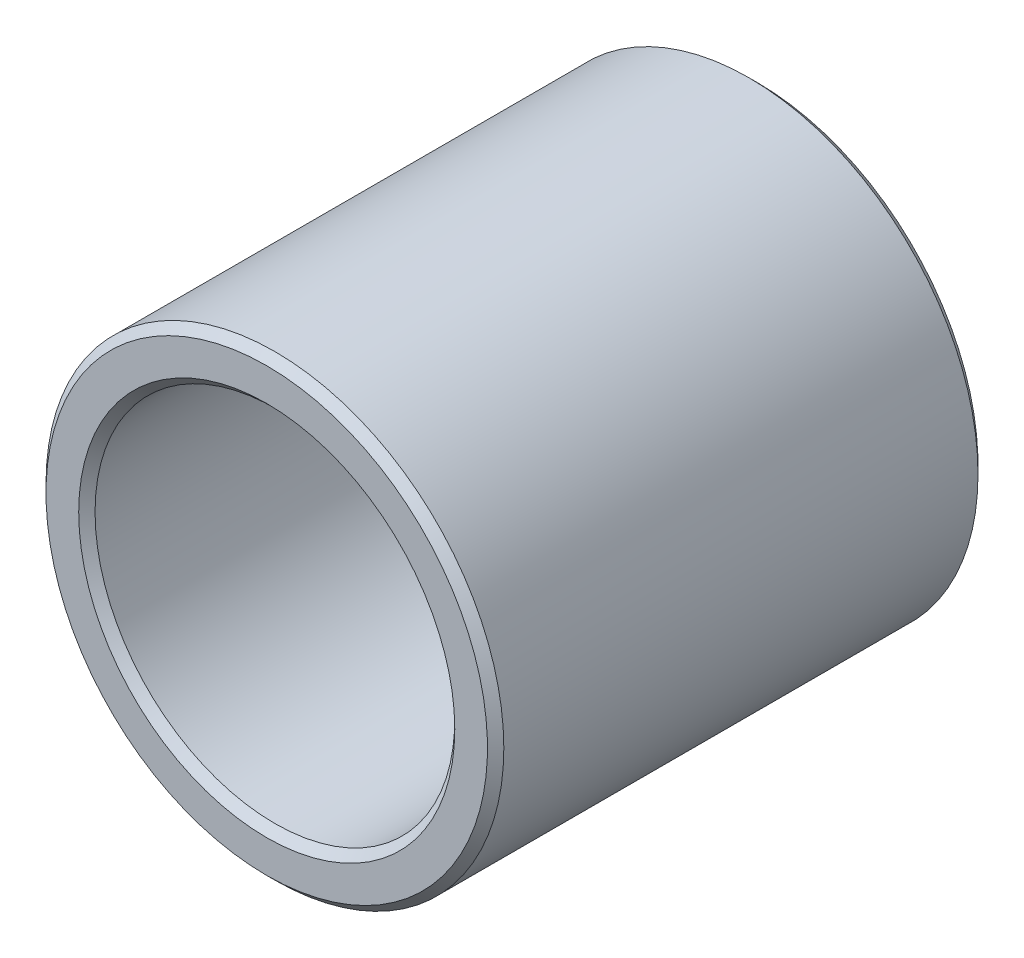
ISO-10303-21;
HEADER;
FILE_DESCRIPTION(('STEP AP214'),'2;1');
FILE_NAME('part.step','',(''),(''),'','','');
FILE_SCHEMA(('AUTOMOTIVE_DESIGN { 1 0 10303 214 1 1 1 1 }'));
ENDSEC;
DATA;
#1=APPLICATION_CONTEXT('core data for automotive mechanical design processes');
#2=APPLICATION_PROTOCOL_DEFINITION('international standard','automotive_design',2000,#1);
#3=PRODUCT_CONTEXT('',#1,'mechanical');
#4=PRODUCT('Part','Part','',(#3));
#5=PRODUCT_RELATED_PRODUCT_CATEGORY('part','',(#4));
#6=PRODUCT_DEFINITION_FORMATION('','',#4);
#7=PRODUCT_DEFINITION_CONTEXT('part definition',#1,'design');
#8=PRODUCT_DEFINITION('design','',#6,#7);
#9=PRODUCT_DEFINITION_SHAPE('','',#8);
#10=(LENGTH_UNIT() NAMED_UNIT(*) SI_UNIT(.MILLI.,.METRE.));
#11=(NAMED_UNIT(*) PLANE_ANGLE_UNIT() SI_UNIT($,.RADIAN.));
#12=(NAMED_UNIT(*) SI_UNIT($,.STERADIAN.) SOLID_ANGLE_UNIT());
#13=UNCERTAINTY_MEASURE_WITH_UNIT(LENGTH_MEASURE(1.E-05),#10,'distance_accuracy_value','');
#14=(GEOMETRIC_REPRESENTATION_CONTEXT(3) GLOBAL_UNCERTAINTY_ASSIGNED_CONTEXT((#13)) GLOBAL_UNIT_ASSIGNED_CONTEXT((#10,
#11,#12)) REPRESENTATION_CONTEXT('',''));
#15=CARTESIAN_POINT('',(0.,0.,0.));
#16=DIRECTION('',(0.,0.,1.));
#17=DIRECTION('',(1.,0.,0.));
#18=AXIS2_PLACEMENT_3D('',#15,#16,#17);
#19=CARTESIAN_POINT('',(0.,0.,0.));
#20=DIRECTION('',(0.,0.,1.));
#21=DIRECTION('',(1.,0.,0.));
#22=AXIS2_PLACEMENT_3D('',#19,#20,#21);
#23=CYLINDRICAL_SURFACE('',#22,11.);
#24=CARTESIAN_POINT('',(0.,0.,0.500000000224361));
#25=DIRECTION('',(0.,0.,-1.));
#26=DIRECTION('',(-1.,0.,0.));
#27=AXIS2_PLACEMENT_3D('',#24,#25,#26);
#28=CIRCLE('',#27,11.0000000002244);
#29=CARTESIAN_POINT('',(-11.0000000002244,0.,0.500000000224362));
#30=VERTEX_POINT('',#29);
#31=EDGE_CURVE('E34',#30,#30,#28,.T.);
#32=ORIENTED_EDGE('',*,*,#31,.T.);
#33=EDGE_LOOP('',(#32));
#34=FACE_BOUND('',#33,.T.);
#35=CARTESIAN_POINT('',(0.,0.,29.4999999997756));
#36=DIRECTION('',(0.,0.,1.));
#37=DIRECTION('',(-1.,0.,0.));
#38=AXIS2_PLACEMENT_3D('',#35,#36,#37);
#39=CIRCLE('',#38,11.0000000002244);
#40=CARTESIAN_POINT('',(-11.0000000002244,0.,29.4999999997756));
#41=VERTEX_POINT('',#40);
#42=EDGE_CURVE('E37',#41,#41,#39,.T.);
#43=ORIENTED_EDGE('',*,*,#42,.T.);
#44=EDGE_LOOP('',(#43));
#45=FACE_BOUND('',#44,.T.);
#46=ADVANCED_FACE('F15',(#34,#45),#23,.F.);
#47=CARTESIAN_POINT('',(0.,0.,30.0000000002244));
#48=DIRECTION('',(0.,0.,1.));
#49=DIRECTION('',(0.,-1.,0.));
#50=AXIS2_PLACEMENT_3D('',#47,#48,#49);
#51=CONICAL_SURFACE('',#50,11.4999999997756,0.7853981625);
#52=CARTESIAN_POINT('',(0.,0.,30.0000000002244));
#53=DIRECTION('',(0.,0.,1.));
#54=DIRECTION('',(0.,-1.,0.));
#55=AXIS2_PLACEMENT_3D('',#52,#53,#54);
#56=CIRCLE('',#55,11.4999999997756);
#57=CARTESIAN_POINT('',(0.,-11.4999999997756,30.0000000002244));
#58=VERTEX_POINT('',#57);
#59=EDGE_CURVE('E18',#58,#58,#56,.T.);
#60=ORIENTED_EDGE('',*,*,#59,.T.);
#61=EDGE_LOOP('',(#60));
#62=FACE_BOUND('',#61,.T.);
#63=ORIENTED_EDGE('',*,*,#42,.F.);
#64=EDGE_LOOP('',(#63));
#65=FACE_BOUND('',#64,.T.);
#66=ADVANCED_FACE('F55',(#62,#65),#51,.F.);
#67=CARTESIAN_POINT('',(0.,0.,-2.24363333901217E-10));
#68=DIRECTION('',(0.,0.,-1.));
#69=DIRECTION('',(-1.,0.,0.));
#70=AXIS2_PLACEMENT_3D('',#67,#68,#69);
#71=CONICAL_SURFACE('',#70,11.4999999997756,0.785398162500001);
#72=CARTESIAN_POINT('',(0.,0.,-2.24362954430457E-10));
#73=DIRECTION('',(0.,0.,-1.));
#74=DIRECTION('',(-1.,0.,0.));
#75=AXIS2_PLACEMENT_3D('',#72,#73,#74);
#76=CIRCLE('',#75,11.4999999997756);
#77=CARTESIAN_POINT('',(-11.4999999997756,0.,-2.24362954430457E-10));
#78=VERTEX_POINT('',#77);
#79=EDGE_CURVE('E48',#78,#78,#76,.F.);
#80=ORIENTED_EDGE('',*,*,#79,.F.);
#81=EDGE_LOOP('',(#80));
#82=FACE_BOUND('',#81,.T.);
#83=ORIENTED_EDGE('',*,*,#31,.F.);
#84=EDGE_LOOP('',(#83));
#85=FACE_BOUND('',#84,.T.);
#86=ADVANCED_FACE('F62',(#82,#85),#71,.F.);
#87=CARTESIAN_POINT('',(0.,0.,30.));
#88=DIRECTION('',(0.,0.,-1.));
#89=DIRECTION('',(-1.,0.,0.));
#90=AXIS2_PLACEMENT_3D('',#87,#88,#89);
#91=PLANE('',#90);
#92=ORIENTED_EDGE('',*,*,#59,.F.);
#93=EDGE_LOOP('',(#92));
#94=FACE_BOUND('',#93,.T.);
#95=CARTESIAN_POINT('',(0.,0.,30.0000000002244));
#96=DIRECTION('',(0.,0.,-1.));
#97=DIRECTION('',(0.,1.,0.));
#98=AXIS2_PLACEMENT_3D('',#95,#96,#97);
#99=CIRCLE('',#98,13.5000000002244);
#100=CARTESIAN_POINT('',(0.,13.5000000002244,30.0000000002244));
#101=VERTEX_POINT('',#100);
#102=EDGE_CURVE('E46',#101,#101,#99,.T.);
#103=ORIENTED_EDGE('',*,*,#102,.F.);
#104=EDGE_LOOP('',(#103));
#105=FACE_BOUND('',#104,.T.);
#106=ADVANCED_FACE('F58',(#94,#105),#91,.F.);
#107=CARTESIAN_POINT('',(0.,0.,0.));
#108=DIRECTION('',(0.,0.,-1.));
#109=DIRECTION('',(-1.,0.,0.));
#110=AXIS2_PLACEMENT_3D('',#107,#108,#109);
#111=PLANE('',#110);
#112=ORIENTED_EDGE('',*,*,#79,.T.);
#113=EDGE_LOOP('',(#112));
#114=FACE_BOUND('',#113,.T.);
#115=CARTESIAN_POINT('',(0.,0.,-2.24362087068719E-10));
#116=DIRECTION('',(0.,0.,1.));
#117=DIRECTION('',(0.,-1.,0.));
#118=AXIS2_PLACEMENT_3D('',#115,#116,#117);
#119=CIRCLE('',#118,13.5000000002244);
#120=CARTESIAN_POINT('',(0.,-13.5000000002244,-2.24362139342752E-10));
#121=VERTEX_POINT('',#120);
#122=EDGE_CURVE('E27',#121,#121,#119,.T.);
#123=ORIENTED_EDGE('',*,*,#122,.F.);
#124=EDGE_LOOP('',(#123));
#125=FACE_BOUND('',#124,.T.);
#126=ADVANCED_FACE('F61',(#114,#125),#111,.T.);
#127=CARTESIAN_POINT('',(0.,0.,29.4999999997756));
#128=DIRECTION('',(0.,0.,-1.));
#129=DIRECTION('',(0.,1.,0.));
#130=AXIS2_PLACEMENT_3D('',#127,#128,#129);
#131=CONICAL_SURFACE('',#130,13.9999999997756,0.785398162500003);
#132=CARTESIAN_POINT('',(0.,0.,29.5));
#133=DIRECTION('',(0.,0.,1.));
#134=DIRECTION('',(1.,0.,0.));
#135=AXIS2_PLACEMENT_3D('',#132,#133,#134);
#136=CIRCLE('',#135,14.);
#137=CARTESIAN_POINT('',(14.,0.,29.5));
#138=VERTEX_POINT('',#137);
#139=EDGE_CURVE('E22',#138,#138,#136,.F.);
#140=ORIENTED_EDGE('',*,*,#139,.F.);
#141=EDGE_LOOP('',(#140));
#142=FACE_BOUND('',#141,.T.);
#143=ORIENTED_EDGE('',*,*,#102,.T.);
#144=EDGE_LOOP('',(#143));
#145=FACE_BOUND('',#144,.T.);
#146=ADVANCED_FACE('F66',(#142,#145),#131,.T.);
#147=CARTESIAN_POINT('',(0.,0.,0.500000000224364));
#148=DIRECTION('',(0.,0.,1.));
#149=DIRECTION('',(0.,-1.,0.));
#150=AXIS2_PLACEMENT_3D('',#147,#148,#149);
#151=CONICAL_SURFACE('',#150,13.9999999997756,0.785398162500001);
#152=ORIENTED_EDGE('',*,*,#122,.T.);
#153=EDGE_LOOP('',(#152));
#154=FACE_BOUND('',#153,.T.);
#155=CARTESIAN_POINT('',(0.,0.,0.5));
#156=DIRECTION('',(0.,0.,1.));
#157=DIRECTION('',(1.,0.,0.));
#158=AXIS2_PLACEMENT_3D('',#155,#156,#157);
#159=CIRCLE('',#158,14.);
#160=CARTESIAN_POINT('',(14.,0.,0.5));
#161=VERTEX_POINT('',#160);
#162=EDGE_CURVE('E10',#161,#161,#159,.T.);
#163=ORIENTED_EDGE('',*,*,#162,.F.);
#164=EDGE_LOOP('',(#163));
#165=FACE_BOUND('',#164,.T.);
#166=ADVANCED_FACE('F68',(#154,#165),#151,.T.);
#167=CARTESIAN_POINT('',(0.,0.,0.));
#168=DIRECTION('',(0.,0.,1.));
#169=DIRECTION('',(1.,0.,0.));
#170=AXIS2_PLACEMENT_3D('',#167,#168,#169);
#171=CYLINDRICAL_SURFACE('',#170,14.);
#172=ORIENTED_EDGE('',*,*,#162,.T.);
#173=EDGE_LOOP('',(#172));
#174=FACE_BOUND('',#173,.T.);
#175=ORIENTED_EDGE('',*,*,#139,.T.);
#176=EDGE_LOOP('',(#175));
#177=FACE_BOUND('',#176,.T.);
#178=ADVANCED_FACE('F76',(#174,#177),#171,.T.);
#179=CLOSED_SHELL('',(#46,#66,#86,#106,#126,#146,#166,#178));
#180=MANIFOLD_SOLID_BREP('B1',#179);
#181=ADVANCED_BREP_SHAPE_REPRESENTATION('',(#18,#180),#14);
#182=SHAPE_DEFINITION_REPRESENTATION(#9,#181);
ENDSEC;
END-ISO-10303-21;
